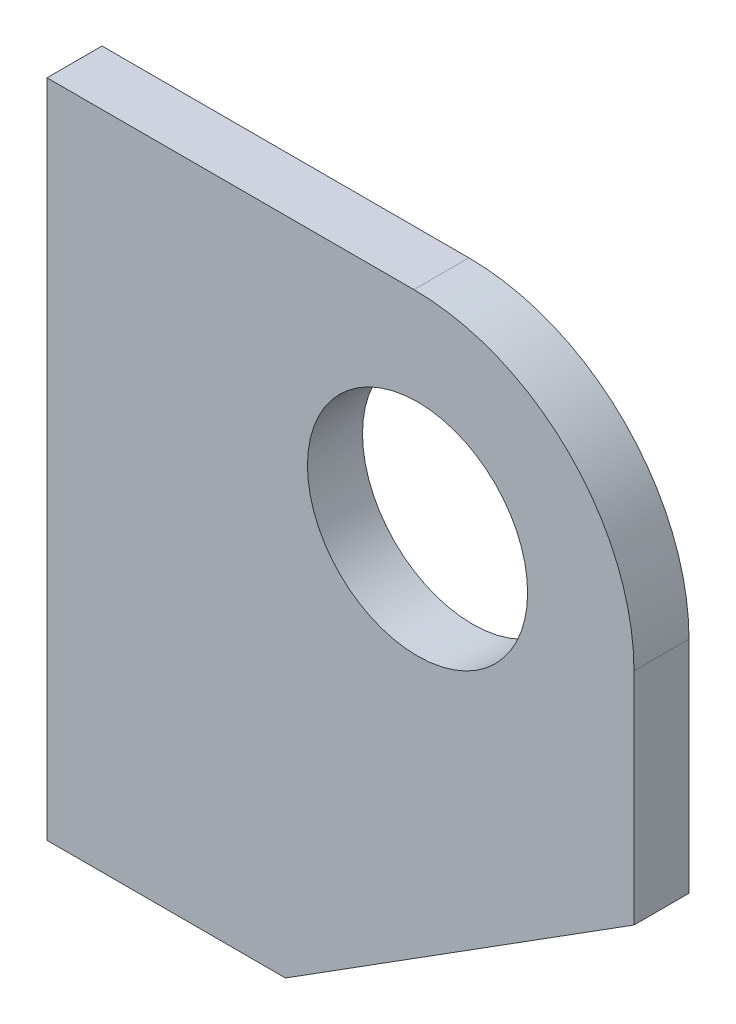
ISO-10303-21;
HEADER;
FILE_DESCRIPTION(('STEP AP214'),'2;1');
FILE_NAME('part.step','',(''),(''),'','','');
FILE_SCHEMA(('AUTOMOTIVE_DESIGN { 1 0 10303 214 1 1 1 1 }'));
ENDSEC;
DATA;
#1=APPLICATION_CONTEXT('core data for automotive mechanical design processes');
#2=APPLICATION_PROTOCOL_DEFINITION('international standard','automotive_design',2000,#1);
#3=PRODUCT_CONTEXT('',#1,'mechanical');
#4=PRODUCT('Part','Part','',(#3));
#5=PRODUCT_RELATED_PRODUCT_CATEGORY('part','',(#4));
#6=PRODUCT_DEFINITION_FORMATION('','',#4);
#7=PRODUCT_DEFINITION_CONTEXT('part definition',#1,'design');
#8=PRODUCT_DEFINITION('design','',#6,#7);
#9=PRODUCT_DEFINITION_SHAPE('','',#8);
#10=(LENGTH_UNIT() NAMED_UNIT(*) SI_UNIT(.MILLI.,.METRE.));
#11=(NAMED_UNIT(*) PLANE_ANGLE_UNIT() SI_UNIT($,.RADIAN.));
#12=(NAMED_UNIT(*) SI_UNIT($,.STERADIAN.) SOLID_ANGLE_UNIT());
#13=UNCERTAINTY_MEASURE_WITH_UNIT(LENGTH_MEASURE(1.E-05),#10,'distance_accuracy_value','');
#14=(GEOMETRIC_REPRESENTATION_CONTEXT(3) GLOBAL_UNCERTAINTY_ASSIGNED_CONTEXT((#13)) GLOBAL_UNIT_ASSIGNED_CONTEXT((#10,
#11,#12)) REPRESENTATION_CONTEXT('',''));
#15=CARTESIAN_POINT('',(0.,0.,0.));
#16=DIRECTION('',(0.,0.,1.));
#17=DIRECTION('',(1.,0.,0.));
#18=AXIS2_PLACEMENT_3D('',#15,#16,#17);
#19=CARTESIAN_POINT('',(0.,0.,15.));
#20=DIRECTION('',(0.,0.,-1.));
#21=DIRECTION('',(-1.,0.,0.));
#22=AXIS2_PLACEMENT_3D('',#19,#20,#21);
#23=PLANE('',#22);
#24=DIRECTION('',(0.,1.,0.));
#25=VECTOR('',#24,1.);
#26=CARTESIAN_POINT('',(160.,180.,15.));
#27=LINE('',#26,#25);
#28=CARTESIAN_POINT('',(160.,60.,15.));
#29=VERTEX_POINT('',#28);
#30=CARTESIAN_POINT('',(160.,120.,15.));
#31=VERTEX_POINT('',#30);
#32=EDGE_CURVE('E95',#29,#31,#27,.T.);
#33=ORIENTED_EDGE('',*,*,#32,.T.);
#34=CARTESIAN_POINT('',(100.,120.,15.));
#35=DIRECTION('',(0.,0.,-1.));
#36=DIRECTION('',(-1.,0.,0.));
#37=AXIS2_PLACEMENT_3D('',#34,#35,#36);
#38=CIRCLE('',#37,60.);
#39=CARTESIAN_POINT('',(100.,180.,15.));
#40=VERTEX_POINT('',#39);
#41=EDGE_CURVE('E11',#31,#40,#38,.F.);
#42=ORIENTED_EDGE('',*,*,#41,.T.);
#43=DIRECTION('',(-1.,0.,0.));
#44=VECTOR('',#43,1.);
#45=CARTESIAN_POINT('',(0.,180.,15.));
#46=LINE('',#45,#44);
#47=CARTESIAN_POINT('',(0.,180.,15.));
#48=VERTEX_POINT('',#47);
#49=EDGE_CURVE('E132',#40,#48,#46,.T.);
#50=ORIENTED_EDGE('',*,*,#49,.T.);
#51=DIRECTION('',(0.,-1.,0.));
#52=VECTOR('',#51,1.);
#53=CARTESIAN_POINT('',(0.,0.,15.));
#54=LINE('',#53,#52);
#55=CARTESIAN_POINT('',(0.,0.,15.));
#56=VERTEX_POINT('',#55);
#57=EDGE_CURVE('E101',#48,#56,#54,.T.);
#58=ORIENTED_EDGE('',*,*,#57,.T.);
#59=DIRECTION('',(1.,0.,0.));
#60=VECTOR('',#59,1.);
#61=CARTESIAN_POINT('',(0.,0.,15.));
#62=LINE('',#61,#60);
#63=CARTESIAN_POINT('',(65.,0.,15.));
#64=VERTEX_POINT('',#63);
#65=EDGE_CURVE('E96',#56,#64,#62,.T.);
#66=ORIENTED_EDGE('',*,*,#65,.T.);
#67=DIRECTION('',(0.845488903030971,0.533992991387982,0.));
#68=VECTOR('',#67,1.);
#69=CARTESIAN_POINT('',(160.,60.,15.));
#70=LINE('',#69,#68);
#71=EDGE_CURVE('E86',#64,#29,#70,.T.);
#72=ORIENTED_EDGE('',*,*,#71,.T.);
#73=EDGE_LOOP('',(#33,#42,#50,#58,#66,#72));
#74=FACE_BOUND('',#73,.T.);
#75=CARTESIAN_POINT('',(101.,124.,15.));
#76=DIRECTION('',(0.,0.,1.));
#77=DIRECTION('',(1.,0.,0.));
#78=AXIS2_PLACEMENT_3D('',#75,#76,#77);
#79=CIRCLE('',#78,30.);
#80=CARTESIAN_POINT('',(131.,124.,15.));
#81=VERTEX_POINT('',#80);
#82=EDGE_CURVE('E130',#81,#81,#79,.T.);
#83=ORIENTED_EDGE('',*,*,#82,.F.);
#84=EDGE_LOOP('',(#83));
#85=FACE_BOUND('',#84,.T.);
#86=ADVANCED_FACE('F33',(#74,#85),#23,.F.);
#87=CARTESIAN_POINT('',(0.,0.,0.));
#88=DIRECTION('',(0.,0.,-1.));
#89=DIRECTION('',(-1.,0.,0.));
#90=AXIS2_PLACEMENT_3D('',#87,#88,#89);
#91=PLANE('',#90);
#92=DIRECTION('',(-1.,0.,0.));
#93=VECTOR('',#92,1.);
#94=CARTESIAN_POINT('',(0.,180.,0.));
#95=LINE('',#94,#93);
#96=CARTESIAN_POINT('',(100.,180.,0.));
#97=VERTEX_POINT('',#96);
#98=CARTESIAN_POINT('',(0.,180.,0.));
#99=VERTEX_POINT('',#98);
#100=EDGE_CURVE('E123',#97,#99,#95,.T.);
#101=ORIENTED_EDGE('',*,*,#100,.F.);
#102=CARTESIAN_POINT('',(100.,120.,0.));
#103=DIRECTION('',(0.,0.,-1.));
#104=DIRECTION('',(-1.,0.,0.));
#105=AXIS2_PLACEMENT_3D('',#102,#103,#104);
#106=CIRCLE('',#105,60.);
#107=CARTESIAN_POINT('',(160.,120.,0.));
#108=VERTEX_POINT('',#107);
#109=EDGE_CURVE('E55',#97,#108,#106,.T.);
#110=ORIENTED_EDGE('',*,*,#109,.T.);
#111=DIRECTION('',(0.,1.,0.));
#112=VECTOR('',#111,1.);
#113=CARTESIAN_POINT('',(160.,180.,0.));
#114=LINE('',#113,#112);
#115=CARTESIAN_POINT('',(160.,60.,0.));
#116=VERTEX_POINT('',#115);
#117=EDGE_CURVE('E125',#116,#108,#114,.T.);
#118=ORIENTED_EDGE('',*,*,#117,.F.);
#119=DIRECTION('',(0.845488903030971,0.533992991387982,0.));
#120=VECTOR('',#119,1.);
#121=CARTESIAN_POINT('',(160.,60.,0.));
#122=LINE('',#121,#120);
#123=CARTESIAN_POINT('',(65.,0.,0.));
#124=VERTEX_POINT('',#123);
#125=EDGE_CURVE('E127',#124,#116,#122,.T.);
#126=ORIENTED_EDGE('',*,*,#125,.F.);
#127=DIRECTION('',(1.,0.,0.));
#128=VECTOR('',#127,1.);
#129=CARTESIAN_POINT('',(0.,0.,0.));
#130=LINE('',#129,#128);
#131=CARTESIAN_POINT('',(0.,0.,0.));
#132=VERTEX_POINT('',#131);
#133=EDGE_CURVE('E109',#132,#124,#130,.T.);
#134=ORIENTED_EDGE('',*,*,#133,.F.);
#135=DIRECTION('',(0.,-1.,0.));
#136=VECTOR('',#135,1.);
#137=CARTESIAN_POINT('',(0.,0.,0.));
#138=LINE('',#137,#136);
#139=EDGE_CURVE('E105',#99,#132,#138,.T.);
#140=ORIENTED_EDGE('',*,*,#139,.F.);
#141=EDGE_LOOP('',(#101,#110,#118,#126,#134,#140));
#142=FACE_BOUND('',#141,.T.);
#143=CARTESIAN_POINT('',(101.,124.,0.));
#144=DIRECTION('',(0.,0.,1.));
#145=DIRECTION('',(1.,0.,0.));
#146=AXIS2_PLACEMENT_3D('',#143,#144,#145);
#147=CIRCLE('',#146,30.);
#148=CARTESIAN_POINT('',(131.,124.,0.));
#149=VERTEX_POINT('',#148);
#150=EDGE_CURVE('E135',#149,#149,#147,.T.);
#151=ORIENTED_EDGE('',*,*,#150,.T.);
#152=EDGE_LOOP('',(#151));
#153=FACE_BOUND('',#152,.T.);
#154=ADVANCED_FACE('F144',(#142,#153),#91,.T.);
#155=CARTESIAN_POINT('',(0.,0.,15.));
#156=DIRECTION('',(0.,1.,0.));
#157=DIRECTION('',(0.,0.,1.));
#158=AXIS2_PLACEMENT_3D('',#155,#156,#157);
#159=PLANE('',#158);
#160=ORIENTED_EDGE('',*,*,#133,.T.);
#161=DIRECTION('',(0.,0.,-1.));
#162=VECTOR('',#161,1.);
#163=CARTESIAN_POINT('',(65.,0.,15.));
#164=LINE('',#163,#162);
#165=EDGE_CURVE('E90',#64,#124,#164,.T.);
#166=ORIENTED_EDGE('',*,*,#165,.F.);
#167=ORIENTED_EDGE('',*,*,#65,.F.);
#168=DIRECTION('',(0.,0.,-1.));
#169=VECTOR('',#168,1.);
#170=CARTESIAN_POINT('',(0.,0.,15.));
#171=LINE('',#170,#169);
#172=EDGE_CURVE('E120',#56,#132,#171,.T.);
#173=ORIENTED_EDGE('',*,*,#172,.T.);
#174=EDGE_LOOP('',(#160,#166,#167,#173));
#175=FACE_BOUND('',#174,.T.);
#176=ADVANCED_FACE('F107',(#175),#159,.F.);
#177=CARTESIAN_POINT('',(160.,60.,15.));
#178=DIRECTION('',(-0.533992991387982,0.845488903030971,0.));
#179=DIRECTION('',(-0.845488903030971,-0.533992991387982,0.));
#180=AXIS2_PLACEMENT_3D('',#177,#178,#179);
#181=PLANE('',#180);
#182=ORIENTED_EDGE('',*,*,#125,.T.);
#183=DIRECTION('',(0.,0.,-1.));
#184=VECTOR('',#183,1.);
#185=CARTESIAN_POINT('',(160.,60.,15.));
#186=LINE('',#185,#184);
#187=EDGE_CURVE('E93',#29,#116,#186,.T.);
#188=ORIENTED_EDGE('',*,*,#187,.F.);
#189=ORIENTED_EDGE('',*,*,#71,.F.);
#190=ORIENTED_EDGE('',*,*,#165,.T.);
#191=EDGE_LOOP('',(#182,#188,#189,#190));
#192=FACE_BOUND('',#191,.T.);
#193=ADVANCED_FACE('F88',(#192),#181,.F.);
#194=CARTESIAN_POINT('',(160.,180.,15.));
#195=DIRECTION('',(-1.,0.,0.));
#196=DIRECTION('',(0.,-1.,0.));
#197=AXIS2_PLACEMENT_3D('',#194,#195,#196);
#198=PLANE('',#197);
#199=ORIENTED_EDGE('',*,*,#117,.T.);
#200=DIRECTION('',(0.,0.,-1.));
#201=VECTOR('',#200,1.);
#202=CARTESIAN_POINT('',(160.,120.,15.));
#203=LINE('',#202,#201);
#204=EDGE_CURVE('E41',#108,#31,#203,.F.);
#205=ORIENTED_EDGE('',*,*,#204,.T.);
#206=ORIENTED_EDGE('',*,*,#32,.F.);
#207=ORIENTED_EDGE('',*,*,#187,.T.);
#208=EDGE_LOOP('',(#199,#205,#206,#207));
#209=FACE_BOUND('',#208,.T.);
#210=ADVANCED_FACE('F159',(#209),#198,.F.);
#211=CARTESIAN_POINT('',(0.,180.,15.));
#212=DIRECTION('',(0.,-1.,0.));
#213=DIRECTION('',(0.,0.,-1.));
#214=AXIS2_PLACEMENT_3D('',#211,#212,#213);
#215=PLANE('',#214);
#216=ORIENTED_EDGE('',*,*,#49,.F.);
#217=DIRECTION('',(0.,0.,-1.));
#218=VECTOR('',#217,1.);
#219=CARTESIAN_POINT('',(100.,180.,15.));
#220=LINE('',#219,#218);
#221=EDGE_CURVE('E110',#40,#97,#220,.T.);
#222=ORIENTED_EDGE('',*,*,#221,.T.);
#223=ORIENTED_EDGE('',*,*,#100,.T.);
#224=DIRECTION('',(0.,0.,-1.));
#225=VECTOR('',#224,1.);
#226=CARTESIAN_POINT('',(0.,180.,15.));
#227=LINE('',#226,#225);
#228=EDGE_CURVE('E114',#48,#99,#227,.T.);
#229=ORIENTED_EDGE('',*,*,#228,.F.);
#230=EDGE_LOOP('',(#216,#222,#223,#229));
#231=FACE_BOUND('',#230,.T.);
#232=ADVANCED_FACE('F155',(#231),#215,.F.);
#233=CARTESIAN_POINT('',(0.,0.,15.));
#234=DIRECTION('',(1.,0.,0.));
#235=DIRECTION('',(0.,0.,-1.));
#236=AXIS2_PLACEMENT_3D('',#233,#234,#235);
#237=PLANE('',#236);
#238=ORIENTED_EDGE('',*,*,#139,.T.);
#239=ORIENTED_EDGE('',*,*,#172,.F.);
#240=ORIENTED_EDGE('',*,*,#57,.F.);
#241=ORIENTED_EDGE('',*,*,#228,.T.);
#242=EDGE_LOOP('',(#238,#239,#240,#241));
#243=FACE_BOUND('',#242,.T.);
#244=ADVANCED_FACE('F152',(#243),#237,.F.);
#245=CARTESIAN_POINT('',(101.,124.,15.));
#246=DIRECTION('',(0.,0.,-1.));
#247=DIRECTION('',(-1.,0.,0.));
#248=AXIS2_PLACEMENT_3D('',#245,#246,#247);
#249=CYLINDRICAL_SURFACE('',#248,30.);
#250=ORIENTED_EDGE('',*,*,#82,.T.);
#251=EDGE_LOOP('',(#250));
#252=FACE_BOUND('',#251,.T.);
#253=ORIENTED_EDGE('',*,*,#150,.F.);
#254=EDGE_LOOP('',(#253));
#255=FACE_BOUND('',#254,.T.);
#256=ADVANCED_FACE('F141',(#252,#255),#249,.F.);
#257=CARTESIAN_POINT('',(100.,120.,15.));
#258=DIRECTION('',(0.,0.,-1.));
#259=DIRECTION('',(-1.,0.,0.));
#260=AXIS2_PLACEMENT_3D('',#257,#258,#259);
#261=CYLINDRICAL_SURFACE('',#260,60.);
#262=ORIENTED_EDGE('',*,*,#41,.F.);
#263=ORIENTED_EDGE('',*,*,#204,.F.);
#264=ORIENTED_EDGE('',*,*,#109,.F.);
#265=ORIENTED_EDGE('',*,*,#221,.F.);
#266=EDGE_LOOP('',(#262,#263,#264,#265));
#267=FACE_BOUND('',#266,.T.);
#268=ADVANCED_FACE('F35',(#267),#261,.T.);
#269=CLOSED_SHELL('',(#86,#154,#176,#193,#210,#232,#244,#256,#268));
#270=MANIFOLD_SOLID_BREP('B2',#269);
#271=ADVANCED_BREP_SHAPE_REPRESENTATION('',(#18,#270),#14);
#272=SHAPE_DEFINITION_REPRESENTATION(#9,#271);
ENDSEC;
END-ISO-10303-21;
